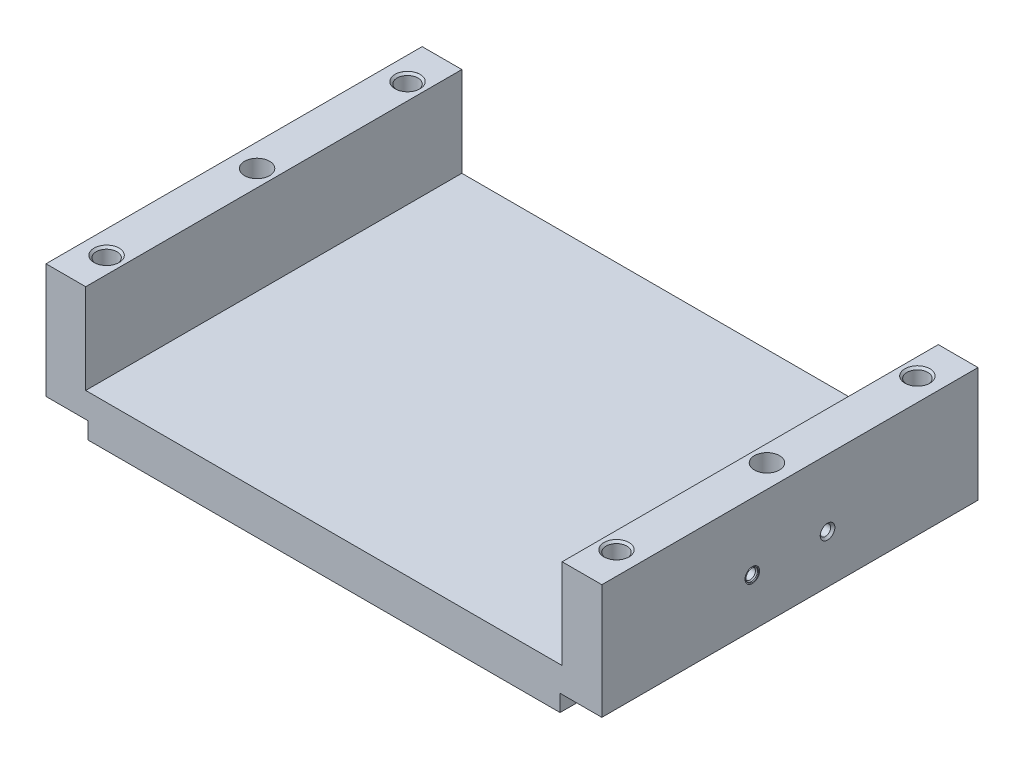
ISO-10303-21;
HEADER;
FILE_DESCRIPTION(('STEP AP214'),'2;1');
FILE_NAME('part.step','',(''),(''),'','','');
FILE_SCHEMA(('AUTOMOTIVE_DESIGN { 1 0 10303 214 1 1 1 1 }'));
ENDSEC;
DATA;
#1=APPLICATION_CONTEXT('core data for automotive mechanical design processes');
#2=APPLICATION_PROTOCOL_DEFINITION('international standard','automotive_design',2000,#1);
#3=PRODUCT_CONTEXT('',#1,'mechanical');
#4=PRODUCT('Part','Part','',(#3));
#5=PRODUCT_RELATED_PRODUCT_CATEGORY('part','',(#4));
#6=PRODUCT_DEFINITION_FORMATION('','',#4);
#7=PRODUCT_DEFINITION_CONTEXT('part definition',#1,'design');
#8=PRODUCT_DEFINITION('design','',#6,#7);
#9=PRODUCT_DEFINITION_SHAPE('','',#8);
#10=(LENGTH_UNIT() NAMED_UNIT(*) SI_UNIT(.MILLI.,.METRE.));
#11=(NAMED_UNIT(*) PLANE_ANGLE_UNIT() SI_UNIT($,.RADIAN.));
#12=(NAMED_UNIT(*) SI_UNIT($,.STERADIAN.) SOLID_ANGLE_UNIT());
#13=UNCERTAINTY_MEASURE_WITH_UNIT(LENGTH_MEASURE(1.E-05),#10,'distance_accuracy_value','');
#14=(GEOMETRIC_REPRESENTATION_CONTEXT(3) GLOBAL_UNCERTAINTY_ASSIGNED_CONTEXT((#13)) GLOBAL_UNIT_ASSIGNED_CONTEXT((#10,
#11,#12)) REPRESENTATION_CONTEXT('',''));
#15=CARTESIAN_POINT('',(0.,0.,0.));
#16=DIRECTION('',(0.,0.,1.));
#17=DIRECTION('',(1.,0.,0.));
#18=AXIS2_PLACEMENT_3D('',#15,#16,#17);
#19=CARTESIAN_POINT('',(-59.30362026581,26.5,9.));
#20=DIRECTION('',(-1.,0.,0.));
#21=DIRECTION('',(0.,0.,1.));
#22=AXIS2_PLACEMENT_3D('',#19,#20,#21);
#23=CYLINDRICAL_SURFACE('',#22,1.5);
#24=CARTESIAN_POINT('',(-59.5,26.5,9.));
#25=DIRECTION('',(-1.,0.,0.));
#26=DIRECTION('',(0.,0.,1.));
#27=AXIS2_PLACEMENT_3D('',#24,#25,#26);
#28=CIRCLE('',#27,1.5);
#29=CARTESIAN_POINT('',(-59.5,26.5,10.5));
#30=VERTEX_POINT('',#29);
#31=EDGE_CURVE('P0_E16',#30,#30,#28,.T.);
#32=ORIENTED_EDGE('',*,*,#31,.T.);
#33=EDGE_LOOP('',(#32));
#34=FACE_BOUND('',#33,.T.);
#35=CARTESIAN_POINT('',(-66.5,26.5,9.));
#36=DIRECTION('',(-1.,0.,0.));
#37=DIRECTION('',(0.,0.,1.));
#38=AXIS2_PLACEMENT_3D('',#35,#36,#37);
#39=CIRCLE('',#38,1.5);
#40=CARTESIAN_POINT('',(-66.5,26.5,10.5));
#41=VERTEX_POINT('',#40);
#42=EDGE_CURVE('P0_E10',#41,#41,#39,.F.);
#43=ORIENTED_EDGE('',*,*,#42,.T.);
#44=EDGE_LOOP('',(#43));
#45=FACE_BOUND('',#44,.T.);
#46=ADVANCED_FACE('P0_F15',(#34,#45),#23,.T.);
#47=OPEN_SHELL('',(#46));
#48=SHELL_BASED_SURFACE_MODEL('P0_B1',(#47));
#49=CARTESIAN_POINT('',(-66.69637973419,26.5,-9.));
#50=DIRECTION('',(1.,0.,0.));
#51=DIRECTION('',(0.,0.,-1.));
#52=AXIS2_PLACEMENT_3D('',#49,#50,#51);
#53=CYLINDRICAL_SURFACE('',#52,1.5);
#54=CARTESIAN_POINT('',(-59.5,26.5,-9.));
#55=DIRECTION('',(1.,0.,0.));
#56=DIRECTION('',(0.,0.,-1.));
#57=AXIS2_PLACEMENT_3D('',#54,#55,#56);
#58=CIRCLE('',#57,1.5);
#59=CARTESIAN_POINT('',(-59.5,26.5,-10.5));
#60=VERTEX_POINT('',#59);
#61=EDGE_CURVE('P1_E16',#60,#60,#58,.F.);
#62=ORIENTED_EDGE('',*,*,#61,.T.);
#63=EDGE_LOOP('',(#62));
#64=FACE_BOUND('',#63,.T.);
#65=CARTESIAN_POINT('',(-66.5,26.5,-9.));
#66=DIRECTION('',(1.,0.,0.));
#67=DIRECTION('',(0.,0.,-1.));
#68=AXIS2_PLACEMENT_3D('',#65,#66,#67);
#69=CIRCLE('',#68,1.5);
#70=CARTESIAN_POINT('',(-66.5,26.5,-10.5));
#71=VERTEX_POINT('',#70);
#72=EDGE_CURVE('P1_E10',#71,#71,#69,.T.);
#73=ORIENTED_EDGE('',*,*,#72,.T.);
#74=EDGE_LOOP('',(#73));
#75=FACE_BOUND('',#74,.T.);
#76=ADVANCED_FACE('P1_F15',(#64,#75),#53,.T.);
#77=OPEN_SHELL('',(#76));
#78=SHELL_BASED_SURFACE_MODEL('P1_B1',(#77));
#79=CARTESIAN_POINT('',(-61.,27.5,-36.));
#80=DIRECTION('',(0.,1.,0.));
#81=DIRECTION('',(0.,0.,1.));
#82=AXIS2_PLACEMENT_3D('',#79,#80,#81);
#83=PLANE('',#82);
#84=CARTESIAN_POINT('',(-61.,27.5,-36.));
#85=DIRECTION('',(0.,1.,0.));
#86=DIRECTION('',(0.,0.,1.));
#87=AXIS2_PLACEMENT_3D('',#84,#85,#86);
#88=CIRCLE('',#87,2.5);
#89=CARTESIAN_POINT('',(-61.,27.5,-33.5));
#90=VERTEX_POINT('',#89);
#91=EDGE_CURVE('P2_E20',#90,#90,#88,.T.);
#92=ORIENTED_EDGE('',*,*,#91,.T.);
#93=EDGE_LOOP('',(#92));
#94=FACE_BOUND('',#93,.T.);
#95=ADVANCED_FACE('P2_F17',(#94),#83,.T.);
#96=CARTESIAN_POINT('',(-61.,27.5,36.));
#97=DIRECTION('',(0.,1.,0.));
#98=DIRECTION('',(0.,0.,1.));
#99=AXIS2_PLACEMENT_3D('',#96,#97,#98);
#100=PLANE('',#99);
#101=CARTESIAN_POINT('',(-61.,27.5,36.));
#102=DIRECTION('',(0.,1.,0.));
#103=DIRECTION('',(0.,0.,1.));
#104=AXIS2_PLACEMENT_3D('',#101,#102,#103);
#105=CIRCLE('',#104,2.5);
#106=CARTESIAN_POINT('',(-61.,27.5,38.5));
#107=VERTEX_POINT('',#106);
#108=EDGE_CURVE('P2_E232',#107,#107,#105,.T.);
#109=ORIENTED_EDGE('',*,*,#108,.T.);
#110=EDGE_LOOP('',(#109));
#111=FACE_BOUND('',#110,.T.);
#112=ADVANCED_FACE('P2_F472',(#111),#100,.T.);
#113=CARTESIAN_POINT('',(-59.5,26.5,-9.));
#114=DIRECTION('',(1.,0.,0.));
#115=DIRECTION('',(0.,0.,-1.));
#116=AXIS2_PLACEMENT_3D('',#113,#114,#115);
#117=PLANE('',#116);
#118=CARTESIAN_POINT('',(-59.5,26.5,-9.));
#119=DIRECTION('',(-1.,0.,0.));
#120=DIRECTION('',(0.,0.,1.));
#121=AXIS2_PLACEMENT_3D('',#118,#119,#120);
#122=CIRCLE('',#121,1.25);
#123=CARTESIAN_POINT('',(-59.5,26.5,-7.75));
#124=VERTEX_POINT('',#123);
#125=EDGE_CURVE('P2_E230',#124,#124,#122,.T.);
#126=ORIENTED_EDGE('',*,*,#125,.T.);
#127=EDGE_LOOP('',(#126));
#128=FACE_BOUND('',#127,.T.);
#129=ADVANCED_FACE('P2_F469',(#128),#117,.F.);
#130=CARTESIAN_POINT('',(-59.5,26.5,9.));
#131=DIRECTION('',(1.,0.,0.));
#132=DIRECTION('',(0.,0.,-1.));
#133=AXIS2_PLACEMENT_3D('',#130,#131,#132);
#134=PLANE('',#133);
#135=CARTESIAN_POINT('',(-59.5,26.5,9.));
#136=DIRECTION('',(-1.,0.,0.));
#137=DIRECTION('',(0.,0.,1.));
#138=AXIS2_PLACEMENT_3D('',#135,#136,#137);
#139=CIRCLE('',#138,1.25);
#140=CARTESIAN_POINT('',(-59.5,26.5,10.25));
#141=VERTEX_POINT('',#140);
#142=EDGE_CURVE('P2_E227',#141,#141,#139,.T.);
#143=ORIENTED_EDGE('',*,*,#142,.T.);
#144=EDGE_LOOP('',(#143));
#145=FACE_BOUND('',#144,.T.);
#146=ADVANCED_FACE('P2_F465',(#145),#134,.F.);
#147=CARTESIAN_POINT('',(59.5,26.5,-9.));
#148=DIRECTION('',(1.,0.,0.));
#149=DIRECTION('',(0.,0.,-1.));
#150=AXIS2_PLACEMENT_3D('',#147,#148,#149);
#151=PLANE('',#150);
#152=CARTESIAN_POINT('',(59.5,26.5,-9.));
#153=DIRECTION('',(-1.,0.,0.));
#154=DIRECTION('',(0.,0.,1.));
#155=AXIS2_PLACEMENT_3D('',#152,#153,#154);
#156=CIRCLE('',#155,1.25);
#157=CARTESIAN_POINT('',(59.5,26.5,-7.75));
#158=VERTEX_POINT('',#157);
#159=EDGE_CURVE('P2_E224',#158,#158,#156,.F.);
#160=ORIENTED_EDGE('',*,*,#159,.T.);
#161=EDGE_LOOP('',(#160));
#162=FACE_BOUND('',#161,.T.);
#163=ADVANCED_FACE('P2_F461',(#162),#151,.T.);
#164=CARTESIAN_POINT('',(59.5,26.5,9.));
#165=DIRECTION('',(1.,0.,0.));
#166=DIRECTION('',(0.,0.,-1.));
#167=AXIS2_PLACEMENT_3D('',#164,#165,#166);
#168=PLANE('',#167);
#169=CARTESIAN_POINT('',(59.5,26.5,9.));
#170=DIRECTION('',(-1.,0.,0.));
#171=DIRECTION('',(0.,0.,1.));
#172=AXIS2_PLACEMENT_3D('',#169,#170,#171);
#173=CIRCLE('',#172,1.25);
#174=CARTESIAN_POINT('',(59.5,26.5,10.25));
#175=VERTEX_POINT('',#174);
#176=EDGE_CURVE('P2_E221',#175,#175,#173,.F.);
#177=ORIENTED_EDGE('',*,*,#176,.T.);
#178=EDGE_LOOP('',(#177));
#179=FACE_BOUND('',#178,.T.);
#180=ADVANCED_FACE('P2_F457',(#179),#168,.T.);
#181=CARTESIAN_POINT('',(61.,27.5,-36.));
#182=DIRECTION('',(0.,1.,0.));
#183=DIRECTION('',(0.,0.,1.));
#184=AXIS2_PLACEMENT_3D('',#181,#182,#183);
#185=PLANE('',#184);
#186=CARTESIAN_POINT('',(61.,27.5,-36.));
#187=DIRECTION('',(0.,1.,0.));
#188=DIRECTION('',(0.,0.,1.));
#189=AXIS2_PLACEMENT_3D('',#186,#187,#188);
#190=CIRCLE('',#189,2.5);
#191=CARTESIAN_POINT('',(61.,27.5,-33.5));
#192=VERTEX_POINT('',#191);
#193=EDGE_CURVE('P2_E218',#192,#192,#190,.T.);
#194=ORIENTED_EDGE('',*,*,#193,.T.);
#195=EDGE_LOOP('',(#194));
#196=FACE_BOUND('',#195,.T.);
#197=ADVANCED_FACE('P2_F453',(#196),#185,.T.);
#198=CARTESIAN_POINT('',(61.,27.5,36.));
#199=DIRECTION('',(0.,1.,0.));
#200=DIRECTION('',(0.,0.,1.));
#201=AXIS2_PLACEMENT_3D('',#198,#199,#200);
#202=PLANE('',#201);
#203=CARTESIAN_POINT('',(61.,27.5,36.));
#204=DIRECTION('',(0.,1.,0.));
#205=DIRECTION('',(0.,0.,1.));
#206=AXIS2_PLACEMENT_3D('',#203,#204,#205);
#207=CIRCLE('',#206,2.5);
#208=CARTESIAN_POINT('',(61.,27.5,38.5));
#209=VERTEX_POINT('',#208);
#210=EDGE_CURVE('P2_E215',#209,#209,#207,.T.);
#211=ORIENTED_EDGE('',*,*,#210,.T.);
#212=EDGE_LOOP('',(#211));
#213=FACE_BOUND('',#212,.T.);
#214=ADVANCED_FACE('P2_F449',(#213),#202,.T.);
#215=CARTESIAN_POINT('',(-61.,27.5,0.));
#216=DIRECTION('',(0.,1.,0.));
#217=DIRECTION('',(0.,0.,1.));
#218=AXIS2_PLACEMENT_3D('',#215,#216,#217);
#219=PLANE('',#218);
#220=CARTESIAN_POINT('',(-61.,27.5,0.));
#221=DIRECTION('',(0.,1.,0.));
#222=DIRECTION('',(0.,0.,1.));
#223=AXIS2_PLACEMENT_3D('',#220,#221,#222);
#224=CIRCLE('',#223,3.);
#225=CARTESIAN_POINT('',(-61.,27.5,3.));
#226=VERTEX_POINT('',#225);
#227=EDGE_CURVE('P2_E188',#226,#226,#224,.T.);
#228=ORIENTED_EDGE('',*,*,#227,.T.);
#229=EDGE_LOOP('',(#228));
#230=FACE_BOUND('',#229,.T.);
#231=ADVANCED_FACE('P2_F244',(#230),#219,.T.);
#232=CARTESIAN_POINT('',(-61.,27.21,-36.));
#233=DIRECTION('',(0.,1.,0.));
#234=DIRECTION('',(0.,0.,1.));
#235=AXIS2_PLACEMENT_3D('',#232,#233,#234);
#236=CYLINDRICAL_SURFACE('',#235,2.5);
#237=ORIENTED_EDGE('',*,*,#91,.F.);
#238=EDGE_LOOP('',(#237));
#239=FACE_BOUND('',#238,.T.);
#240=CARTESIAN_POINT('',(-61.,42.00000000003,-36.));
#241=DIRECTION('',(0.,1.,0.));
#242=DIRECTION('',(0.,0.,-1.));
#243=AXIS2_PLACEMENT_3D('',#240,#241,#242);
#244=CIRCLE('',#243,2.49999999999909);
#245=CARTESIAN_POINT('',(-61.,42.00000000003,-38.4999999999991));
#246=VERTEX_POINT('',#245);
#247=EDGE_CURVE('P2_E185',#246,#246,#244,.T.);
#248=ORIENTED_EDGE('',*,*,#247,.T.);
#249=EDGE_LOOP('',(#248));
#250=FACE_BOUND('',#249,.T.);
#251=ADVANCED_FACE('P2_F240',(#239,#250),#236,.F.);
#252=CARTESIAN_POINT('',(-61.,27.21,36.));
#253=DIRECTION('',(0.,1.,0.));
#254=DIRECTION('',(0.,0.,1.));
#255=AXIS2_PLACEMENT_3D('',#252,#253,#254);
#256=CYLINDRICAL_SURFACE('',#255,2.5);
#257=ORIENTED_EDGE('',*,*,#108,.F.);
#258=EDGE_LOOP('',(#257));
#259=FACE_BOUND('',#258,.T.);
#260=CARTESIAN_POINT('',(-61.,42.00000000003,36.));
#261=DIRECTION('',(0.,1.,0.));
#262=DIRECTION('',(0.,0.,-1.));
#263=AXIS2_PLACEMENT_3D('',#260,#261,#262);
#264=CIRCLE('',#263,2.49999999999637);
#265=CARTESIAN_POINT('',(-61.,42.00000000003,33.5000000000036));
#266=VERTEX_POINT('',#265);
#267=EDGE_CURVE('P2_E180',#266,#266,#264,.T.);
#268=ORIENTED_EDGE('',*,*,#267,.T.);
#269=EDGE_LOOP('',(#268));
#270=FACE_BOUND('',#269,.T.);
#271=ADVANCED_FACE('P2_F243',(#259,#270),#256,.F.);
#272=CARTESIAN_POINT('',(-59.30362026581,26.5,-9.));
#273=DIRECTION('',(-1.,0.,0.));
#274=DIRECTION('',(0.,0.,1.));
#275=AXIS2_PLACEMENT_3D('',#272,#273,#274);
#276=CYLINDRICAL_SURFACE('',#275,1.25);
#277=ORIENTED_EDGE('',*,*,#125,.F.);
#278=EDGE_LOOP('',(#277));
#279=FACE_BOUND('',#278,.T.);
#280=CARTESIAN_POINT('',(-65.9999999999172,26.5,-9.));
#281=DIRECTION('',(-1.,0.,0.));
#282=DIRECTION('',(0.,0.,-1.));
#283=AXIS2_PLACEMENT_3D('',#280,#281,#282);
#284=CIRCLE('',#283,1.24999999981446);
#285=CARTESIAN_POINT('',(-65.9999999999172,26.5,-10.2499999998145));
#286=VERTEX_POINT('',#285);
#287=EDGE_CURVE('P2_E177',#286,#286,#284,.T.);
#288=ORIENTED_EDGE('',*,*,#287,.T.);
#289=EDGE_LOOP('',(#288));
#290=FACE_BOUND('',#289,.T.);
#291=ADVANCED_FACE('P2_F439',(#279,#290),#276,.F.);
#292=CARTESIAN_POINT('',(-59.30362026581,26.5,9.));
#293=DIRECTION('',(-1.,0.,0.));
#294=DIRECTION('',(0.,0.,1.));
#295=AXIS2_PLACEMENT_3D('',#292,#293,#294);
#296=CYLINDRICAL_SURFACE('',#295,1.25);
#297=ORIENTED_EDGE('',*,*,#142,.F.);
#298=EDGE_LOOP('',(#297));
#299=FACE_BOUND('',#298,.T.);
#300=CARTESIAN_POINT('',(-65.9999999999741,26.5,9.));
#301=DIRECTION('',(-1.,0.,0.));
#302=DIRECTION('',(0.,0.,-1.));
#303=AXIS2_PLACEMENT_3D('',#300,#301,#302);
#304=CIRCLE('',#303,1.25000000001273);
#305=CARTESIAN_POINT('',(-65.9999999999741,26.5,7.74999999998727));
#306=VERTEX_POINT('',#305);
#307=EDGE_CURVE('P2_E174',#306,#306,#304,.T.);
#308=ORIENTED_EDGE('',*,*,#307,.T.);
#309=EDGE_LOOP('',(#308));
#310=FACE_BOUND('',#309,.T.);
#311=ADVANCED_FACE('P2_F435',(#299,#310),#296,.F.);
#312=CARTESIAN_POINT('',(66.19637973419,26.5,-9.));
#313=DIRECTION('',(-1.,0.,0.));
#314=DIRECTION('',(0.,0.,1.));
#315=AXIS2_PLACEMENT_3D('',#312,#313,#314);
#316=CYLINDRICAL_SURFACE('',#315,1.25);
#317=ORIENTED_EDGE('',*,*,#159,.F.);
#318=EDGE_LOOP('',(#317));
#319=FACE_BOUND('',#318,.T.);
#320=CARTESIAN_POINT('',(65.9999999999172,26.5,-9.));
#321=DIRECTION('',(1.,0.,0.));
#322=DIRECTION('',(0.,0.,-1.));
#323=AXIS2_PLACEMENT_3D('',#320,#321,#322);
#324=CIRCLE('',#323,1.24999999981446);
#325=CARTESIAN_POINT('',(65.9999999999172,26.5,-10.2499999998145));
#326=VERTEX_POINT('',#325);
#327=EDGE_CURVE('P2_E171',#326,#326,#324,.T.);
#328=ORIENTED_EDGE('',*,*,#327,.T.);
#329=EDGE_LOOP('',(#328));
#330=FACE_BOUND('',#329,.T.);
#331=ADVANCED_FACE('P2_F431',(#319,#330),#316,.F.);
#332=CARTESIAN_POINT('',(66.19637973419,26.5,9.));
#333=DIRECTION('',(-1.,0.,0.));
#334=DIRECTION('',(0.,0.,1.));
#335=AXIS2_PLACEMENT_3D('',#332,#333,#334);
#336=CYLINDRICAL_SURFACE('',#335,1.25);
#337=ORIENTED_EDGE('',*,*,#176,.F.);
#338=EDGE_LOOP('',(#337));
#339=FACE_BOUND('',#338,.T.);
#340=CARTESIAN_POINT('',(65.9999999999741,26.5,9.));
#341=DIRECTION('',(1.,0.,0.));
#342=DIRECTION('',(0.,0.,-1.));
#343=AXIS2_PLACEMENT_3D('',#340,#341,#342);
#344=CIRCLE('',#343,1.25000000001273);
#345=CARTESIAN_POINT('',(65.9999999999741,26.5,7.74999999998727));
#346=VERTEX_POINT('',#345);
#347=EDGE_CURVE('P2_E168',#346,#346,#344,.T.);
#348=ORIENTED_EDGE('',*,*,#347,.T.);
#349=EDGE_LOOP('',(#348));
#350=FACE_BOUND('',#349,.T.);
#351=ADVANCED_FACE('P2_F427',(#339,#350),#336,.F.);
#352=CARTESIAN_POINT('',(61.,27.5,0.));
#353=DIRECTION('',(0.,1.,0.));
#354=DIRECTION('',(0.,0.,1.));
#355=AXIS2_PLACEMENT_3D('',#352,#353,#354);
#356=PLANE('',#355);
#357=CARTESIAN_POINT('',(61.,27.5,0.));
#358=DIRECTION('',(0.,1.,0.));
#359=DIRECTION('',(0.,0.,1.));
#360=AXIS2_PLACEMENT_3D('',#357,#358,#359);
#361=CIRCLE('',#360,3.);
#362=CARTESIAN_POINT('',(61.,27.5,3.));
#363=VERTEX_POINT('',#362);
#364=EDGE_CURVE('P2_E167',#363,#363,#361,.T.);
#365=ORIENTED_EDGE('',*,*,#364,.T.);
#366=EDGE_LOOP('',(#365));
#367=FACE_BOUND('',#366,.T.);
#368=ADVANCED_FACE('P2_F423',(#367),#356,.T.);
#369=CARTESIAN_POINT('',(61.,27.21,-36.));
#370=DIRECTION('',(0.,1.,0.));
#371=DIRECTION('',(0.,0.,1.));
#372=AXIS2_PLACEMENT_3D('',#369,#370,#371);
#373=CYLINDRICAL_SURFACE('',#372,2.5);
#374=ORIENTED_EDGE('',*,*,#193,.F.);
#375=EDGE_LOOP('',(#374));
#376=FACE_BOUND('',#375,.T.);
#377=CARTESIAN_POINT('',(61.,41.99999999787,-36.));
#378=DIRECTION('',(0.,1.,0.));
#379=DIRECTION('',(0.,0.,-1.));
#380=AXIS2_PLACEMENT_3D('',#377,#378,#379);
#381=CIRCLE('',#380,2.49999999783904);
#382=CARTESIAN_POINT('',(61.,41.99999999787,-38.499999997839));
#383=VERTEX_POINT('',#382);
#384=EDGE_CURVE('P2_E164',#383,#383,#381,.T.);
#385=ORIENTED_EDGE('',*,*,#384,.T.);
#386=EDGE_LOOP('',(#385));
#387=FACE_BOUND('',#386,.T.);
#388=ADVANCED_FACE('P2_F419',(#376,#387),#373,.F.);
#389=CARTESIAN_POINT('',(61.,27.21,36.));
#390=DIRECTION('',(0.,1.,0.));
#391=DIRECTION('',(0.,0.,1.));
#392=AXIS2_PLACEMENT_3D('',#389,#390,#391);
#393=CYLINDRICAL_SURFACE('',#392,2.5);
#394=ORIENTED_EDGE('',*,*,#210,.F.);
#395=EDGE_LOOP('',(#394));
#396=FACE_BOUND('',#395,.T.);
#397=CARTESIAN_POINT('',(61.,42.00000000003,36.));
#398=DIRECTION('',(0.,1.,0.));
#399=DIRECTION('',(0.,0.,-1.));
#400=AXIS2_PLACEMENT_3D('',#397,#398,#399);
#401=CIRCLE('',#400,2.49999999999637);
#402=CARTESIAN_POINT('',(61.,42.00000000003,33.5000000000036));
#403=VERTEX_POINT('',#402);
#404=EDGE_CURVE('P2_E160',#403,#403,#401,.T.);
#405=ORIENTED_EDGE('',*,*,#404,.T.);
#406=EDGE_LOOP('',(#405));
#407=FACE_BOUND('',#406,.T.);
#408=ADVANCED_FACE('P2_F415',(#396,#407),#393,.F.);
#409=CARTESIAN_POINT('',(-61.,27.2,0.));
#410=DIRECTION('',(0.,1.,0.));
#411=DIRECTION('',(0.,0.,1.));
#412=AXIS2_PLACEMENT_3D('',#409,#410,#411);
#413=CYLINDRICAL_SURFACE('',#412,3.);
#414=ORIENTED_EDGE('',*,*,#227,.F.);
#415=EDGE_LOOP('',(#414));
#416=FACE_BOUND('',#415,.T.);
#417=CARTESIAN_POINT('',(-61.,42.5,0.));
#418=DIRECTION('',(0.,1.,0.));
#419=DIRECTION('',(0.,0.,1.));
#420=AXIS2_PLACEMENT_3D('',#417,#418,#419);
#421=CIRCLE('',#420,3.);
#422=CARTESIAN_POINT('',(-61.,42.5,3.));
#423=VERTEX_POINT('',#422);
#424=EDGE_CURVE('P2_E163',#423,#423,#421,.F.);
#425=ORIENTED_EDGE('',*,*,#424,.F.);
#426=EDGE_LOOP('',(#425));
#427=FACE_BOUND('',#426,.T.);
#428=ADVANCED_FACE('P2_F252',(#416,#427),#413,.F.);
#429=CARTESIAN_POINT('',(-61.,42.5000000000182,-36.));
#430=DIRECTION('',(0.,1.,0.));
#431=DIRECTION('',(0.,0.,1.));
#432=AXIS2_PLACEMENT_3D('',#429,#430,#431);
#433=CONICAL_SURFACE('',#432,3.00000000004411,0.785398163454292);
#434=ORIENTED_EDGE('',*,*,#247,.F.);
#435=EDGE_LOOP('',(#434));
#436=FACE_BOUND('',#435,.T.);
#437=CARTESIAN_POINT('',(-61.,42.5000000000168,-36.));
#438=DIRECTION('',(0.,1.,0.));
#439=DIRECTION('',(0.,0.,1.));
#440=AXIS2_PLACEMENT_3D('',#437,#438,#439);
#441=CIRCLE('',#440,3.00000000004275);
#442=CARTESIAN_POINT('',(-61.,42.5000000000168,-32.9999999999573));
#443=VERTEX_POINT('',#442);
#444=EDGE_CURVE('P2_E206',#443,#443,#441,.F.);
#445=ORIENTED_EDGE('',*,*,#444,.F.);
#446=EDGE_LOOP('',(#445));
#447=FACE_BOUND('',#446,.T.);
#448=ADVANCED_FACE('P2_F248',(#436,#447),#433,.F.);
#449=CARTESIAN_POINT('',(-61.,42.5000000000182,36.));
#450=DIRECTION('',(0.,1.,0.));
#451=DIRECTION('',(0.,0.,1.));
#452=AXIS2_PLACEMENT_3D('',#449,#450,#451);
#453=CONICAL_SURFACE('',#452,3.00000000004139,0.785398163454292);
#454=ORIENTED_EDGE('',*,*,#267,.F.);
#455=EDGE_LOOP('',(#454));
#456=FACE_BOUND('',#455,.T.);
#457=CARTESIAN_POINT('',(-61.,42.5000000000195,36.));
#458=DIRECTION('',(0.,1.,0.));
#459=DIRECTION('',(0.,0.,1.));
#460=AXIS2_PLACEMENT_3D('',#457,#458,#459);
#461=CIRCLE('',#460,3.00000000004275);
#462=CARTESIAN_POINT('',(-61.,42.5000000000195,39.0000000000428));
#463=VERTEX_POINT('',#462);
#464=EDGE_CURVE('P2_E159',#463,#463,#461,.F.);
#465=ORIENTED_EDGE('',*,*,#464,.F.);
#466=EDGE_LOOP('',(#465));
#467=FACE_BOUND('',#466,.T.);
#468=ADVANCED_FACE('P2_F251',(#456,#467),#453,.F.);
#469=CARTESIAN_POINT('',(-66.5000000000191,26.5,-9.));
#470=DIRECTION('',(-1.,0.,0.));
#471=DIRECTION('',(0.,0.,1.));
#472=AXIS2_PLACEMENT_3D('',#469,#470,#471);
#473=CONICAL_SURFACE('',#472,1.74999999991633,0.785398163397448);
#474=ORIENTED_EDGE('',*,*,#287,.F.);
#475=EDGE_LOOP('',(#474));
#476=FACE_BOUND('',#475,.T.);
#477=CARTESIAN_POINT('',(-66.5000000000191,26.5,-9.));
#478=DIRECTION('',(-1.,0.,0.));
#479=DIRECTION('',(0.,0.,1.));
#480=AXIS2_PLACEMENT_3D('',#477,#478,#479);
#481=CIRCLE('',#480,1.74999999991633);
#482=CARTESIAN_POINT('',(-66.5000000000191,26.5,-7.25000000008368));
#483=VERTEX_POINT('',#482);
#484=EDGE_CURVE('P2_E158',#483,#483,#481,.T.);
#485=ORIENTED_EDGE('',*,*,#484,.T.);
#486=EDGE_LOOP('',(#485));
#487=FACE_BOUND('',#486,.T.);
#488=ADVANCED_FACE('P2_F405',(#476,#487),#473,.F.);
#489=CARTESIAN_POINT('',(-66.5000000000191,26.5,9.));
#490=DIRECTION('',(-1.,0.,0.));
#491=DIRECTION('',(0.,0.,1.));
#492=AXIS2_PLACEMENT_3D('',#489,#490,#491);
#493=CONICAL_SURFACE('',#492,1.75000000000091,0.785398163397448);
#494=ORIENTED_EDGE('',*,*,#307,.F.);
#495=EDGE_LOOP('',(#494));
#496=FACE_BOUND('',#495,.T.);
#497=CARTESIAN_POINT('',(-66.5000000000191,26.5,9.));
#498=DIRECTION('',(-1.,0.,0.));
#499=DIRECTION('',(0.,0.,1.));
#500=AXIS2_PLACEMENT_3D('',#497,#498,#499);
#501=CIRCLE('',#500,1.75000000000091);
#502=CARTESIAN_POINT('',(-66.5000000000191,26.5,10.7500000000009));
#503=VERTEX_POINT('',#502);
#504=EDGE_CURVE('P2_E120',#503,#503,#501,.T.);
#505=ORIENTED_EDGE('',*,*,#504,.T.);
#506=EDGE_LOOP('',(#505));
#507=FACE_BOUND('',#506,.T.);
#508=ADVANCED_FACE('P2_F401',(#496,#507),#493,.F.);
#509=CARTESIAN_POINT('',(66.5000000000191,26.5,-9.));
#510=DIRECTION('',(1.,0.,0.));
#511=DIRECTION('',(0.,0.,-1.));
#512=AXIS2_PLACEMENT_3D('',#509,#510,#511);
#513=CONICAL_SURFACE('',#512,1.74999999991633,0.785398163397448);
#514=ORIENTED_EDGE('',*,*,#327,.F.);
#515=EDGE_LOOP('',(#514));
#516=FACE_BOUND('',#515,.T.);
#517=CARTESIAN_POINT('',(66.5000000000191,26.5,-9.));
#518=DIRECTION('',(1.,0.,0.));
#519=DIRECTION('',(0.,0.,-1.));
#520=AXIS2_PLACEMENT_3D('',#517,#518,#519);
#521=CIRCLE('',#520,1.74999999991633);
#522=CARTESIAN_POINT('',(66.5000000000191,26.5,-10.7499999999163));
#523=VERTEX_POINT('',#522);
#524=EDGE_CURVE('P2_E148',#523,#523,#521,.F.);
#525=ORIENTED_EDGE('',*,*,#524,.F.);
#526=EDGE_LOOP('',(#525));
#527=FACE_BOUND('',#526,.T.);
#528=ADVANCED_FACE('P2_F397',(#516,#527),#513,.F.);
#529=CARTESIAN_POINT('',(66.5000000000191,26.5,9.));
#530=DIRECTION('',(1.,0.,0.));
#531=DIRECTION('',(0.,0.,-1.));
#532=AXIS2_PLACEMENT_3D('',#529,#530,#531);
#533=CONICAL_SURFACE('',#532,1.75000000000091,0.785398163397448);
#534=ORIENTED_EDGE('',*,*,#347,.F.);
#535=EDGE_LOOP('',(#534));
#536=FACE_BOUND('',#535,.T.);
#537=CARTESIAN_POINT('',(66.5000000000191,26.5,9.));
#538=DIRECTION('',(1.,0.,0.));
#539=DIRECTION('',(0.,0.,-1.));
#540=AXIS2_PLACEMENT_3D('',#537,#538,#539);
#541=CIRCLE('',#540,1.75000000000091);
#542=CARTESIAN_POINT('',(66.5000000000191,26.5,7.24999999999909));
#543=VERTEX_POINT('',#542);
#544=EDGE_CURVE('P2_E144',#543,#543,#541,.F.);
#545=ORIENTED_EDGE('',*,*,#544,.F.);
#546=EDGE_LOOP('',(#545));
#547=FACE_BOUND('',#546,.T.);
#548=ADVANCED_FACE('P2_F393',(#536,#547),#533,.F.);
#549=CARTESIAN_POINT('',(61.,27.2,0.));
#550=DIRECTION('',(0.,1.,0.));
#551=DIRECTION('',(0.,0.,1.));
#552=AXIS2_PLACEMENT_3D('',#549,#550,#551);
#553=CYLINDRICAL_SURFACE('',#552,3.);
#554=ORIENTED_EDGE('',*,*,#364,.F.);
#555=EDGE_LOOP('',(#554));
#556=FACE_BOUND('',#555,.T.);
#557=CARTESIAN_POINT('',(61.,42.5,0.));
#558=DIRECTION('',(0.,1.,0.));
#559=DIRECTION('',(0.,0.,1.));
#560=AXIS2_PLACEMENT_3D('',#557,#558,#559);
#561=CIRCLE('',#560,3.);
#562=CARTESIAN_POINT('',(61.,42.5,3.));
#563=VERTEX_POINT('',#562);
#564=EDGE_CURVE('P2_E143',#563,#563,#561,.F.);
#565=ORIENTED_EDGE('',*,*,#564,.F.);
#566=EDGE_LOOP('',(#565));
#567=FACE_BOUND('',#566,.T.);
#568=ADVANCED_FACE('P2_F389',(#556,#567),#553,.F.);
#569=CARTESIAN_POINT('',(61.,42.5000000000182,-36.));
#570=DIRECTION('',(0.,1.,0.));
#571=DIRECTION('',(0.,0.,1.));
#572=AXIS2_PLACEMENT_3D('',#569,#570,#571);
#573=CONICAL_SURFACE('',#572,3.00000000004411,0.785398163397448);
#574=ORIENTED_EDGE('',*,*,#384,.F.);
#575=EDGE_LOOP('',(#574));
#576=FACE_BOUND('',#575,.T.);
#577=CARTESIAN_POINT('',(61.,42.5000000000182,-36.));
#578=DIRECTION('',(0.,1.,0.));
#579=DIRECTION('',(0.,0.,1.));
#580=AXIS2_PLACEMENT_3D('',#577,#578,#579);
#581=CIRCLE('',#580,3.00000000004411);
#582=CARTESIAN_POINT('',(61.,42.5000000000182,-32.9999999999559));
#583=VERTEX_POINT('',#582);
#584=EDGE_CURVE('P2_E191',#583,#583,#581,.F.);
#585=ORIENTED_EDGE('',*,*,#584,.F.);
#586=EDGE_LOOP('',(#585));
#587=FACE_BOUND('',#586,.T.);
#588=ADVANCED_FACE('P2_F385',(#576,#587),#573,.F.);
#589=CARTESIAN_POINT('',(61.,42.5000000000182,36.));
#590=DIRECTION('',(0.,1.,0.));
#591=DIRECTION('',(0.,0.,1.));
#592=AXIS2_PLACEMENT_3D('',#589,#590,#591);
#593=CONICAL_SURFACE('',#592,3.00000000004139,0.785398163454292);
#594=ORIENTED_EDGE('',*,*,#404,.F.);
#595=EDGE_LOOP('',(#594));
#596=FACE_BOUND('',#595,.T.);
#597=CARTESIAN_POINT('',(61.,42.5000000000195,36.));
#598=DIRECTION('',(0.,1.,0.));
#599=DIRECTION('',(0.,0.,1.));
#600=AXIS2_PLACEMENT_3D('',#597,#598,#599);
#601=CIRCLE('',#600,3.00000000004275);
#602=CARTESIAN_POINT('',(61.,42.5000000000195,39.0000000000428));
#603=VERTEX_POINT('',#602);
#604=EDGE_CURVE('P2_E136',#603,#603,#601,.F.);
#605=ORIENTED_EDGE('',*,*,#604,.F.);
#606=EDGE_LOOP('',(#605));
#607=FACE_BOUND('',#606,.T.);
#608=ADVANCED_FACE('P2_F259',(#596,#607),#593,.F.);
#609=CARTESIAN_POINT('',(-61.75,42.5,0.));
#610=DIRECTION('',(0.,1.,0.));
#611=DIRECTION('',(0.,0.,1.));
#612=AXIS2_PLACEMENT_3D('',#609,#610,#611);
#613=PLANE('',#612);
#614=ORIENTED_EDGE('',*,*,#464,.T.);
#615=EDGE_LOOP('',(#614));
#616=FACE_BOUND('',#615,.T.);
#617=ORIENTED_EDGE('',*,*,#444,.T.);
#618=EDGE_LOOP('',(#617));
#619=FACE_BOUND('',#618,.T.);
#620=ORIENTED_EDGE('',*,*,#424,.T.);
#621=EDGE_LOOP('',(#620));
#622=FACE_BOUND('',#621,.T.);
#623=DIRECTION('',(0.,0.,-1.));
#624=VECTOR('',#623,1.);
#625=CARTESIAN_POINT('',(-57.,42.5,0.));
#626=LINE('',#625,#624);
#627=CARTESIAN_POINT('',(-57.,42.5,-45.));
#628=VERTEX_POINT('',#627);
#629=CARTESIAN_POINT('',(-57.,42.5,45.));
#630=VERTEX_POINT('',#629);
#631=EDGE_CURVE('P2_E134',#628,#630,#626,.F.);
#632=ORIENTED_EDGE('',*,*,#631,.F.);
#633=DIRECTION('',(1.,0.,0.));
#634=VECTOR('',#633,1.);
#635=CARTESIAN_POINT('',(0.,42.5,-45.));
#636=LINE('',#635,#634);
#637=CARTESIAN_POINT('',(-66.5,42.5,-45.));
#638=VERTEX_POINT('',#637);
#639=EDGE_CURVE('P2_E265',#628,#638,#636,.F.);
#640=ORIENTED_EDGE('',*,*,#639,.T.);
#641=DIRECTION('',(0.,0.,-1.));
#642=VECTOR('',#641,1.);
#643=CARTESIAN_POINT('',(-66.5,42.5,0.));
#644=LINE('',#643,#642);
#645=CARTESIAN_POINT('',(-66.5,42.5,45.));
#646=VERTEX_POINT('',#645);
#647=EDGE_CURVE('P2_E104',#638,#646,#644,.F.);
#648=ORIENTED_EDGE('',*,*,#647,.T.);
#649=DIRECTION('',(1.,0.,0.));
#650=VECTOR('',#649,1.);
#651=CARTESIAN_POINT('',(0.,42.5,45.));
#652=LINE('',#651,#650);
#653=EDGE_CURVE('P2_E133',#630,#646,#652,.F.);
#654=ORIENTED_EDGE('',*,*,#653,.F.);
#655=EDGE_LOOP('',(#632,#640,#648,#654));
#656=FACE_BOUND('',#655,.T.);
#657=ADVANCED_FACE('P2_F256',(#616,#619,#622,#656),#613,.T.);
#658=CARTESIAN_POINT('',(-66.5,28.75,0.));
#659=DIRECTION('',(1.,0.,0.));
#660=DIRECTION('',(0.,0.,-1.));
#661=AXIS2_PLACEMENT_3D('',#658,#659,#660);
#662=PLANE('',#661);
#663=ORIENTED_EDGE('',*,*,#504,.F.);
#664=EDGE_LOOP('',(#663));
#665=FACE_BOUND('',#664,.T.);
#666=ORIENTED_EDGE('',*,*,#484,.F.);
#667=EDGE_LOOP('',(#666));
#668=FACE_BOUND('',#667,.T.);
#669=DIRECTION('',(0.,1.,0.));
#670=VECTOR('',#669,1.);
#671=CARTESIAN_POINT('',(-66.5,26.75,45.));
#672=LINE('',#671,#670);
#673=CARTESIAN_POINT('',(-66.5,15.,45.));
#674=VERTEX_POINT('',#673);
#675=EDGE_CURVE('P2_E113',#646,#674,#672,.F.);
#676=ORIENTED_EDGE('',*,*,#675,.F.);
#677=ORIENTED_EDGE('',*,*,#647,.F.);
#678=DIRECTION('',(0.,1.,0.));
#679=VECTOR('',#678,1.);
#680=CARTESIAN_POINT('',(-66.5,26.75,-45.));
#681=LINE('',#680,#679);
#682=CARTESIAN_POINT('',(-66.5,15.,-45.));
#683=VERTEX_POINT('',#682);
#684=EDGE_CURVE('P2_E116',#638,#683,#681,.F.);
#685=ORIENTED_EDGE('',*,*,#684,.T.);
#686=DIRECTION('',(0.,0.,1.));
#687=VECTOR('',#686,1.);
#688=CARTESIAN_POINT('',(-66.5,15.,0.));
#689=LINE('',#688,#687);
#690=EDGE_CURVE('P2_E109',#683,#674,#689,.T.);
#691=ORIENTED_EDGE('',*,*,#690,.T.);
#692=EDGE_LOOP('',(#676,#677,#685,#691));
#693=FACE_BOUND('',#692,.T.);
#694=ADVANCED_FACE('P2_F111',(#665,#668,#693),#662,.F.);
#695=CARTESIAN_POINT('',(-61.5,15.,0.));
#696=DIRECTION('',(0.,1.,0.));
#697=DIRECTION('',(0.,0.,1.));
#698=AXIS2_PLACEMENT_3D('',#695,#696,#697);
#699=PLANE('',#698);
#700=DIRECTION('',(1.,0.,0.));
#701=VECTOR('',#700,1.);
#702=CARTESIAN_POINT('',(0.,15.,45.));
#703=LINE('',#702,#701);
#704=CARTESIAN_POINT('',(-56.5,15.,45.));
#705=VERTEX_POINT('',#704);
#706=EDGE_CURVE('P2_E123',#674,#705,#703,.T.);
#707=ORIENTED_EDGE('',*,*,#706,.F.);
#708=ORIENTED_EDGE('',*,*,#690,.F.);
#709=DIRECTION('',(1.,0.,0.));
#710=VECTOR('',#709,1.);
#711=CARTESIAN_POINT('',(0.,15.,-45.));
#712=LINE('',#711,#710);
#713=CARTESIAN_POINT('',(-56.5,15.,-45.));
#714=VERTEX_POINT('',#713);
#715=EDGE_CURVE('P2_E277',#683,#714,#712,.T.);
#716=ORIENTED_EDGE('',*,*,#715,.T.);
#717=DIRECTION('',(0.,0.,-1.));
#718=VECTOR('',#717,1.);
#719=CARTESIAN_POINT('',(-56.5,15.,0.));
#720=LINE('',#719,#718);
#721=EDGE_CURVE('P2_E119',#714,#705,#720,.F.);
#722=ORIENTED_EDGE('',*,*,#721,.T.);
#723=EDGE_LOOP('',(#707,#708,#716,#722));
#724=FACE_BOUND('',#723,.T.);
#725=ADVANCED_FACE('P2_F124',(#724),#699,.F.);
#726=CARTESIAN_POINT('',(-56.5,13.,0.));
#727=DIRECTION('',(1.,0.,0.));
#728=DIRECTION('',(0.,0.,-1.));
#729=AXIS2_PLACEMENT_3D('',#726,#727,#728);
#730=PLANE('',#729);
#731=DIRECTION('',(0.,1.,0.));
#732=VECTOR('',#731,1.);
#733=CARTESIAN_POINT('',(-56.5,26.75,45.));
#734=LINE('',#733,#732);
#735=CARTESIAN_POINT('',(-56.5,11.,45.));
#736=VERTEX_POINT('',#735);
#737=EDGE_CURVE('P2_E129',#705,#736,#734,.F.);
#738=ORIENTED_EDGE('',*,*,#737,.F.);
#739=ORIENTED_EDGE('',*,*,#721,.F.);
#740=DIRECTION('',(0.,1.,0.));
#741=VECTOR('',#740,1.);
#742=CARTESIAN_POINT('',(-56.5,26.75,-45.));
#743=LINE('',#742,#741);
#744=CARTESIAN_POINT('',(-56.5,11.,-45.));
#745=VERTEX_POINT('',#744);
#746=EDGE_CURVE('P2_E306',#714,#745,#743,.F.);
#747=ORIENTED_EDGE('',*,*,#746,.T.);
#748=DIRECTION('',(0.,0.,1.));
#749=VECTOR('',#748,1.);
#750=CARTESIAN_POINT('',(-56.5,11.,0.));
#751=LINE('',#750,#749);
#752=EDGE_CURVE('P2_E154',#745,#736,#751,.T.);
#753=ORIENTED_EDGE('',*,*,#752,.T.);
#754=EDGE_LOOP('',(#738,#739,#747,#753));
#755=FACE_BOUND('',#754,.T.);
#756=ADVANCED_FACE('P2_F303',(#755),#730,.F.);
#757=CARTESIAN_POINT('',(0.,11.,0.));
#758=DIRECTION('',(0.,1.,0.));
#759=DIRECTION('',(0.,0.,1.));
#760=AXIS2_PLACEMENT_3D('',#757,#758,#759);
#761=PLANE('',#760);
#762=DIRECTION('',(1.,0.,0.));
#763=VECTOR('',#762,1.);
#764=CARTESIAN_POINT('',(0.,11.,45.));
#765=LINE('',#764,#763);
#766=CARTESIAN_POINT('',(56.5,11.,45.));
#767=VERTEX_POINT('',#766);
#768=EDGE_CURVE('P2_E299',#736,#767,#765,.T.);
#769=ORIENTED_EDGE('',*,*,#768,.F.);
#770=ORIENTED_EDGE('',*,*,#752,.F.);
#771=DIRECTION('',(1.,0.,0.));
#772=VECTOR('',#771,1.);
#773=CARTESIAN_POINT('',(0.,11.,-45.));
#774=LINE('',#773,#772);
#775=CARTESIAN_POINT('',(56.5,11.,-45.));
#776=VERTEX_POINT('',#775);
#777=EDGE_CURVE('P2_E311',#745,#776,#774,.T.);
#778=ORIENTED_EDGE('',*,*,#777,.T.);
#779=DIRECTION('',(0.,0.,-1.));
#780=VECTOR('',#779,1.);
#781=CARTESIAN_POINT('',(56.5,11.,0.));
#782=LINE('',#781,#780);
#783=EDGE_CURVE('P2_E151',#767,#776,#782,.T.);
#784=ORIENTED_EDGE('',*,*,#783,.F.);
#785=EDGE_LOOP('',(#769,#770,#778,#784));
#786=FACE_BOUND('',#785,.T.);
#787=ADVANCED_FACE('P2_F309',(#786),#761,.F.);
#788=CARTESIAN_POINT('',(56.5,13.,0.));
#789=DIRECTION('',(1.,0.,0.));
#790=DIRECTION('',(0.,0.,-1.));
#791=AXIS2_PLACEMENT_3D('',#788,#789,#790);
#792=PLANE('',#791);
#793=ORIENTED_EDGE('',*,*,#783,.T.);
#794=DIRECTION('',(0.,1.,0.));
#795=VECTOR('',#794,1.);
#796=CARTESIAN_POINT('',(56.5,26.75,-45.));
#797=LINE('',#796,#795);
#798=CARTESIAN_POINT('',(56.5,15.,-45.));
#799=VERTEX_POINT('',#798);
#800=EDGE_CURVE('P2_E347',#776,#799,#797,.T.);
#801=ORIENTED_EDGE('',*,*,#800,.T.);
#802=DIRECTION('',(0.,0.,1.));
#803=VECTOR('',#802,1.);
#804=CARTESIAN_POINT('',(56.5,15.,0.));
#805=LINE('',#804,#803);
#806=CARTESIAN_POINT('',(56.5,15.,45.));
#807=VERTEX_POINT('',#806);
#808=EDGE_CURVE('P2_E149',#799,#807,#805,.T.);
#809=ORIENTED_EDGE('',*,*,#808,.T.);
#810=DIRECTION('',(0.,1.,0.));
#811=VECTOR('',#810,1.);
#812=CARTESIAN_POINT('',(56.5,26.75,45.));
#813=LINE('',#812,#811);
#814=EDGE_CURVE('P2_E296',#767,#807,#813,.T.);
#815=ORIENTED_EDGE('',*,*,#814,.F.);
#816=EDGE_LOOP('',(#793,#801,#809,#815));
#817=FACE_BOUND('',#816,.T.);
#818=ADVANCED_FACE('P2_F314',(#817),#792,.T.);
#819=CARTESIAN_POINT('',(61.5,15.,0.));
#820=DIRECTION('',(0.,1.,0.));
#821=DIRECTION('',(0.,0.,1.));
#822=AXIS2_PLACEMENT_3D('',#819,#820,#821);
#823=PLANE('',#822);
#824=DIRECTION('',(1.,0.,0.));
#825=VECTOR('',#824,1.);
#826=CARTESIAN_POINT('',(0.,15.,45.));
#827=LINE('',#826,#825);
#828=CARTESIAN_POINT('',(66.5,15.,45.));
#829=VERTEX_POINT('',#828);
#830=EDGE_CURVE('P2_E293',#807,#829,#827,.T.);
#831=ORIENTED_EDGE('',*,*,#830,.F.);
#832=ORIENTED_EDGE('',*,*,#808,.F.);
#833=DIRECTION('',(1.,0.,0.));
#834=VECTOR('',#833,1.);
#835=CARTESIAN_POINT('',(0.,15.,-45.));
#836=LINE('',#835,#834);
#837=CARTESIAN_POINT('',(66.5,15.,-45.));
#838=VERTEX_POINT('',#837);
#839=EDGE_CURVE('P2_E321',#799,#838,#836,.T.);
#840=ORIENTED_EDGE('',*,*,#839,.T.);
#841=DIRECTION('',(0.,0.,-1.));
#842=VECTOR('',#841,1.);
#843=CARTESIAN_POINT('',(66.5,15.,0.));
#844=LINE('',#843,#842);
#845=EDGE_CURVE('P2_E145',#829,#838,#844,.T.);
#846=ORIENTED_EDGE('',*,*,#845,.F.);
#847=EDGE_LOOP('',(#831,#832,#840,#846));
#848=FACE_BOUND('',#847,.T.);
#849=ADVANCED_FACE('P2_F319',(#848),#823,.F.);
#850=CARTESIAN_POINT('',(66.5,28.75,0.));
#851=DIRECTION('',(1.,0.,0.));
#852=DIRECTION('',(0.,0.,-1.));
#853=AXIS2_PLACEMENT_3D('',#850,#851,#852);
#854=PLANE('',#853);
#855=ORIENTED_EDGE('',*,*,#544,.T.);
#856=EDGE_LOOP('',(#855));
#857=FACE_BOUND('',#856,.T.);
#858=ORIENTED_EDGE('',*,*,#524,.T.);
#859=EDGE_LOOP('',(#858));
#860=FACE_BOUND('',#859,.T.);
#861=ORIENTED_EDGE('',*,*,#845,.T.);
#862=DIRECTION('',(0.,1.,0.));
#863=VECTOR('',#862,1.);
#864=CARTESIAN_POINT('',(66.5,26.75,-45.));
#865=LINE('',#864,#863);
#866=CARTESIAN_POINT('',(66.5,42.5,-45.));
#867=VERTEX_POINT('',#866);
#868=EDGE_CURVE('P2_E326',#838,#867,#865,.T.);
#869=ORIENTED_EDGE('',*,*,#868,.T.);
#870=DIRECTION('',(0.,0.,1.));
#871=VECTOR('',#870,1.);
#872=CARTESIAN_POINT('',(66.5,42.5,0.));
#873=LINE('',#872,#871);
#874=CARTESIAN_POINT('',(66.5,42.5,45.));
#875=VERTEX_POINT('',#874);
#876=EDGE_CURVE('P2_E140',#875,#867,#873,.F.);
#877=ORIENTED_EDGE('',*,*,#876,.F.);
#878=DIRECTION('',(0.,1.,0.));
#879=VECTOR('',#878,1.);
#880=CARTESIAN_POINT('',(66.5,26.75,45.));
#881=LINE('',#880,#879);
#882=EDGE_CURVE('P2_E290',#829,#875,#881,.T.);
#883=ORIENTED_EDGE('',*,*,#882,.F.);
#884=EDGE_LOOP('',(#861,#869,#877,#883));
#885=FACE_BOUND('',#884,.T.);
#886=ADVANCED_FACE('P2_F324',(#857,#860,#885),#854,.T.);
#887=CARTESIAN_POINT('',(61.75,42.5,0.));
#888=DIRECTION('',(0.,1.,0.));
#889=DIRECTION('',(0.,0.,1.));
#890=AXIS2_PLACEMENT_3D('',#887,#888,#889);
#891=PLANE('',#890);
#892=ORIENTED_EDGE('',*,*,#604,.T.);
#893=EDGE_LOOP('',(#892));
#894=FACE_BOUND('',#893,.T.);
#895=ORIENTED_EDGE('',*,*,#584,.T.);
#896=EDGE_LOOP('',(#895));
#897=FACE_BOUND('',#896,.T.);
#898=ORIENTED_EDGE('',*,*,#564,.T.);
#899=EDGE_LOOP('',(#898));
#900=FACE_BOUND('',#899,.T.);
#901=ORIENTED_EDGE('',*,*,#876,.T.);
#902=DIRECTION('',(1.,0.,0.));
#903=VECTOR('',#902,1.);
#904=CARTESIAN_POINT('',(0.,42.5,-45.));
#905=LINE('',#904,#903);
#906=CARTESIAN_POINT('',(57.,42.5,-45.));
#907=VERTEX_POINT('',#906);
#908=EDGE_CURVE('P2_E343',#867,#907,#905,.F.);
#909=ORIENTED_EDGE('',*,*,#908,.T.);
#910=DIRECTION('',(0.,0.,-1.));
#911=VECTOR('',#910,1.);
#912=CARTESIAN_POINT('',(57.,42.5,0.));
#913=LINE('',#912,#911);
#914=CARTESIAN_POINT('',(57.,42.5,45.));
#915=VERTEX_POINT('',#914);
#916=EDGE_CURVE('P2_E279',#907,#915,#913,.F.);
#917=ORIENTED_EDGE('',*,*,#916,.T.);
#918=DIRECTION('',(1.,0.,0.));
#919=VECTOR('',#918,1.);
#920=CARTESIAN_POINT('',(0.,42.5,45.));
#921=LINE('',#920,#919);
#922=EDGE_CURVE('P2_E287',#875,#915,#921,.F.);
#923=ORIENTED_EDGE('',*,*,#922,.F.);
#924=EDGE_LOOP('',(#901,#909,#917,#923));
#925=FACE_BOUND('',#924,.T.);
#926=ADVANCED_FACE('P2_F329',(#894,#897,#900,#925),#891,.T.);
#927=CARTESIAN_POINT('',(-57.,31.75,0.));
#928=DIRECTION('',(1.,0.,0.));
#929=DIRECTION('',(0.,0.,-1.));
#930=AXIS2_PLACEMENT_3D('',#927,#928,#929);
#931=PLANE('',#930);
#932=DIRECTION('',(0.,0.,1.));
#933=VECTOR('',#932,1.);
#934=CARTESIAN_POINT('',(-57.,21.,0.));
#935=LINE('',#934,#933);
#936=CARTESIAN_POINT('',(-57.,21.,-45.));
#937=VERTEX_POINT('',#936);
#938=CARTESIAN_POINT('',(-57.,21.,45.));
#939=VERTEX_POINT('',#938);
#940=EDGE_CURVE('P2_E271',#937,#939,#935,.T.);
#941=ORIENTED_EDGE('',*,*,#940,.F.);
#942=DIRECTION('',(0.,1.,0.));
#943=VECTOR('',#942,1.);
#944=CARTESIAN_POINT('',(-57.,26.75,-45.));
#945=LINE('',#944,#943);
#946=EDGE_CURVE('P2_E268',#937,#628,#945,.T.);
#947=ORIENTED_EDGE('',*,*,#946,.T.);
#948=ORIENTED_EDGE('',*,*,#631,.T.);
#949=DIRECTION('',(0.,1.,0.));
#950=VECTOR('',#949,1.);
#951=CARTESIAN_POINT('',(-57.,26.75,45.));
#952=LINE('',#951,#950);
#953=EDGE_CURVE('P2_E285',#939,#630,#952,.T.);
#954=ORIENTED_EDGE('',*,*,#953,.F.);
#955=EDGE_LOOP('',(#941,#947,#948,#954));
#956=FACE_BOUND('',#955,.T.);
#957=ADVANCED_FACE('P2_F269',(#956),#931,.T.);
#958=CARTESIAN_POINT('',(0.,26.75,45.));
#959=DIRECTION('',(0.,0.,1.));
#960=DIRECTION('',(1.,0.,0.));
#961=AXIS2_PLACEMENT_3D('',#958,#959,#960);
#962=PLANE('',#961);
#963=ORIENTED_EDGE('',*,*,#953,.T.);
#964=ORIENTED_EDGE('',*,*,#653,.T.);
#965=ORIENTED_EDGE('',*,*,#675,.T.);
#966=ORIENTED_EDGE('',*,*,#706,.T.);
#967=ORIENTED_EDGE('',*,*,#737,.T.);
#968=ORIENTED_EDGE('',*,*,#768,.T.);
#969=ORIENTED_EDGE('',*,*,#814,.T.);
#970=ORIENTED_EDGE('',*,*,#830,.T.);
#971=ORIENTED_EDGE('',*,*,#882,.T.);
#972=ORIENTED_EDGE('',*,*,#922,.T.);
#973=DIRECTION('',(0.,1.,0.));
#974=VECTOR('',#973,1.);
#975=CARTESIAN_POINT('',(57.,31.75,45.));
#976=LINE('',#975,#974);
#977=CARTESIAN_POINT('',(57.,21.,45.));
#978=VERTEX_POINT('',#977);
#979=EDGE_CURVE('P2_E275',#915,#978,#976,.F.);
#980=ORIENTED_EDGE('',*,*,#979,.T.);
#981=DIRECTION('',(1.,0.,0.));
#982=VECTOR('',#981,1.);
#983=CARTESIAN_POINT('',(0.,21.,45.));
#984=LINE('',#983,#982);
#985=EDGE_CURVE('P2_E336',#939,#978,#984,.T.);
#986=ORIENTED_EDGE('',*,*,#985,.F.);
#987=EDGE_LOOP('',(#963,#964,#965,#966,#967,#968,#969,#970,#971,#972,#980,#986));
#988=FACE_BOUND('',#987,.T.);
#989=ADVANCED_FACE('P2_F132',(#988),#962,.T.);
#990=CARTESIAN_POINT('',(57.,31.75,0.));
#991=DIRECTION('',(1.,0.,0.));
#992=DIRECTION('',(0.,0.,-1.));
#993=AXIS2_PLACEMENT_3D('',#990,#991,#992);
#994=PLANE('',#993);
#995=ORIENTED_EDGE('',*,*,#979,.F.);
#996=ORIENTED_EDGE('',*,*,#916,.F.);
#997=DIRECTION('',(0.,1.,0.));
#998=VECTOR('',#997,1.);
#999=CARTESIAN_POINT('',(57.,26.75,-45.));
#1000=LINE('',#999,#998);
#1001=CARTESIAN_POINT('',(57.,21.,-45.));
#1002=VERTEX_POINT('',#1001);
#1003=EDGE_CURVE('P2_E35',#907,#1002,#1000,.F.);
#1004=ORIENTED_EDGE('',*,*,#1003,.T.);
#1005=DIRECTION('',(0.,0.,1.));
#1006=VECTOR('',#1005,1.);
#1007=CARTESIAN_POINT('',(57.,21.,0.));
#1008=LINE('',#1007,#1006);
#1009=EDGE_CURVE('P2_E26',#978,#1002,#1008,.F.);
#1010=ORIENTED_EDGE('',*,*,#1009,.F.);
#1011=EDGE_LOOP('',(#995,#996,#1004,#1010));
#1012=FACE_BOUND('',#1011,.T.);
#1013=ADVANCED_FACE('P2_F332',(#1012),#994,.F.);
#1014=CARTESIAN_POINT('',(0.,26.75,-45.));
#1015=DIRECTION('',(0.,0.,1.));
#1016=DIRECTION('',(1.,0.,0.));
#1017=AXIS2_PLACEMENT_3D('',#1014,#1015,#1016);
#1018=PLANE('',#1017);
#1019=DIRECTION('',(1.,0.,0.));
#1020=VECTOR('',#1019,1.);
#1021=CARTESIAN_POINT('',(0.,21.,-45.));
#1022=LINE('',#1021,#1020);
#1023=EDGE_CURVE('P2_E11',#1002,#937,#1022,.F.);
#1024=ORIENTED_EDGE('',*,*,#1023,.F.);
#1025=ORIENTED_EDGE('',*,*,#1003,.F.);
#1026=ORIENTED_EDGE('',*,*,#908,.F.);
#1027=ORIENTED_EDGE('',*,*,#868,.F.);
#1028=ORIENTED_EDGE('',*,*,#839,.F.);
#1029=ORIENTED_EDGE('',*,*,#800,.F.);
#1030=ORIENTED_EDGE('',*,*,#777,.F.);
#1031=ORIENTED_EDGE('',*,*,#746,.F.);
#1032=ORIENTED_EDGE('',*,*,#715,.F.);
#1033=ORIENTED_EDGE('',*,*,#684,.F.);
#1034=ORIENTED_EDGE('',*,*,#639,.F.);
#1035=ORIENTED_EDGE('',*,*,#946,.F.);
#1036=EDGE_LOOP('',(#1024,#1025,#1026,#1027,#1028,#1029,#1030,#1031,#1032,#1033,#1034,#1035));
#1037=FACE_BOUND('',#1036,.T.);
#1038=ADVANCED_FACE('P2_F274',(#1037),#1018,.F.);
#1039=CARTESIAN_POINT('',(0.,21.,0.));
#1040=DIRECTION('',(0.,1.,0.));
#1041=DIRECTION('',(0.,0.,1.));
#1042=AXIS2_PLACEMENT_3D('',#1039,#1040,#1041);
#1043=PLANE('',#1042);
#1044=ORIENTED_EDGE('',*,*,#1009,.T.);
#1045=ORIENTED_EDGE('',*,*,#1023,.T.);
#1046=ORIENTED_EDGE('',*,*,#940,.T.);
#1047=ORIENTED_EDGE('',*,*,#985,.T.);
#1048=EDGE_LOOP('',(#1044,#1045,#1046,#1047));
#1049=FACE_BOUND('',#1048,.T.);
#1050=ADVANCED_FACE('P2_F338',(#1049),#1043,.T.);
#1051=CLOSED_SHELL('',(#95,#112,#129,#146,#163,#180,#197,#214,#231,#251,#271,#291,#311,#331,
#351,#368,#388,#408,#428,#448,#468,#488,#508,#528,#548,#568,#588,#608,#657,#694,#725,#756,#787,
#818,#849,#886,#926,#957,#989,#1013,#1038,#1050));
#1052=MANIFOLD_SOLID_BREP('P2_B1',#1051);
#1053=CARTESIAN_POINT('',(-61.,42.8,-36.));
#1054=DIRECTION('',(0.,-1.,0.));
#1055=DIRECTION('',(0.,0.,-1.));
#1056=AXIS2_PLACEMENT_3D('',#1053,#1054,#1055);
#1057=CYLINDRICAL_SURFACE('',#1056,3.);
#1058=CARTESIAN_POINT('',(-61.,27.5,-36.));
#1059=DIRECTION('',(0.,-1.,0.));
#1060=DIRECTION('',(0.,0.,-1.));
#1061=AXIS2_PLACEMENT_3D('',#1058,#1059,#1060);
#1062=CIRCLE('',#1061,3.);
#1063=CARTESIAN_POINT('',(-61.,27.5,-39.));
#1064=VERTEX_POINT('',#1063);
#1065=EDGE_CURVE('P3_E21',#1064,#1064,#1062,.F.);
#1066=ORIENTED_EDGE('',*,*,#1065,.T.);
#1067=EDGE_LOOP('',(#1066));
#1068=FACE_BOUND('',#1067,.T.);
#1069=CARTESIAN_POINT('',(-61.,42.5,-36.));
#1070=DIRECTION('',(0.,-1.,0.));
#1071=DIRECTION('',(0.,0.,-1.));
#1072=AXIS2_PLACEMENT_3D('',#1069,#1070,#1071);
#1073=CIRCLE('',#1072,3.);
#1074=CARTESIAN_POINT('',(-61.,42.5,-39.));
#1075=VERTEX_POINT('',#1074);
#1076=EDGE_CURVE('P3_E11',#1075,#1075,#1073,.T.);
#1077=ORIENTED_EDGE('',*,*,#1076,.T.);
#1078=EDGE_LOOP('',(#1077));
#1079=FACE_BOUND('',#1078,.T.);
#1080=ADVANCED_FACE('P3_F17',(#1068,#1079),#1057,.T.);
#1081=CARTESIAN_POINT('',(-61.,27.5,-36.));
#1082=DIRECTION('',(0.,1.,0.));
#1083=DIRECTION('',(0.,0.,1.));
#1084=AXIS2_PLACEMENT_3D('',#1081,#1082,#1083);
#1085=PLANE('',#1084);
#1086=CARTESIAN_POINT('',(-58.5,27.5,-36.));
#1087=CARTESIAN_POINT('',(-58.5034299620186,27.5,-35.4934961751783));
#1088=CARTESIAN_POINT('',(-58.691241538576,27.5,-35.041574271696));
#1089=CARTESIAN_POINT('',(-58.8818050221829,27.5,-34.5830305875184));
#1090=CARTESIAN_POINT('',(-59.2309361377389,27.5,-34.2334730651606));
#1091=CARTESIAN_POINT('',(-59.5800941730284,27.5,-33.8838885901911));
#1092=CARTESIAN_POINT('',(-60.0352241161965,27.5,-33.6937315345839));
#1093=CARTESIAN_POINT('',(-60.494039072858,27.5,-33.5020348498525));
#1094=CARTESIAN_POINT('',(-60.9900232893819,27.5,-33.499968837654));
#1095=CARTESIAN_POINT('',(-61.4849447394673,27.5,-33.4979072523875));
#1096=CARTESIAN_POINT('',(-61.9455727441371,27.5,-33.6857726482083));
#1097=CARTESIAN_POINT('',(-62.4039381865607,27.5,-33.8727152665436));
#1098=CARTESIAN_POINT('',(-62.7579091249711,27.5,-34.2223661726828));
#1099=CARTESIAN_POINT('',(-63.1121639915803,27.5,-34.5722975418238));
#1100=CARTESIAN_POINT('',(-63.3065756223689,27.5,-35.0365905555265));
#1101=CARTESIAN_POINT('',(-63.4972848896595,27.5,-35.4920416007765));
#1102=CARTESIAN_POINT('',(-63.5,27.5,-36.));
#1103=B_SPLINE_CURVE_WITH_KNOTS('',2,(#1086,#1087,#1088,#1089,#1090,#1091,#1092,#1093,#1094,
#1095,#1096,#1097,#1098,#1099,#1100,#1101,#1102),.UNSPECIFIED.,.F.,.F.,(3,2,2,2,2,2,2,2,3),(0.,
0.125,0.25,0.375,0.5,0.625,0.75,0.875,1.),.UNSPECIFIED.);
#1104=CARTESIAN_POINT('',(-58.5,27.5,-36.));
#1105=VERTEX_POINT('',#1104);
#1106=CARTESIAN_POINT('',(-63.5,27.5,-36.));
#1107=VERTEX_POINT('',#1106);
#1108=EDGE_CURVE('P3_E29',#1105,#1107,#1103,.T.);
#1109=ORIENTED_EDGE('',*,*,#1108,.F.);
#1110=CARTESIAN_POINT('',(-63.5,27.5,-36.));
#1111=CARTESIAN_POINT('',(-63.4965700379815,27.5,-36.5065038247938));
#1112=CARTESIAN_POINT('',(-63.308758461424,27.5,-36.958425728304));
#1113=CARTESIAN_POINT('',(-63.1181949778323,27.5,-37.4169694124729));
#1114=CARTESIAN_POINT('',(-62.7690638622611,27.5,-37.7665269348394));
#1115=CARTESIAN_POINT('',(-62.4199058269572,27.5,-38.1161114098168));
#1116=CARTESIAN_POINT('',(-61.9647758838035,27.5,-38.3062684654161));
#1117=CARTESIAN_POINT('',(-61.5059609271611,27.5,-38.4979651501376));
#1118=CARTESIAN_POINT('',(-61.0099767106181,27.5,-38.5000311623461));
#1119=CARTESIAN_POINT('',(-60.5150552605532,27.5,-38.5020927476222));
#1120=CARTESIAN_POINT('',(-60.0544272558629,27.5,-38.3142273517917));
#1121=CARTESIAN_POINT('',(-59.5960618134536,27.5,-38.1272847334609));
#1122=CARTESIAN_POINT('',(-59.2420908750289,27.5,-37.7776338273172));
#1123=CARTESIAN_POINT('',(-58.8878360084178,27.5,-37.427702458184));
#1124=CARTESIAN_POINT('',(-58.6934243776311,27.5,-36.9634094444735));
#1125=CARTESIAN_POINT('',(-58.5027151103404,27.5,-36.5079583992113));
#1126=CARTESIAN_POINT('',(-58.5,27.5,-36.));
#1127=B_SPLINE_CURVE_WITH_KNOTS('',2,(#1110,#1111,#1112,#1113,#1114,#1115,#1116,#1117,#1118,
#1119,#1120,#1121,#1122,#1123,#1124,#1125,#1126),.UNSPECIFIED.,.F.,.F.,(3,2,2,2,2,2,2,2,3),(0.,
0.125,0.25,0.375,0.5,0.625,0.75,0.875,1.),.UNSPECIFIED.);
#1128=EDGE_CURVE('P3_E34',#1107,#1105,#1127,.T.);
#1129=ORIENTED_EDGE('',*,*,#1128,.F.);
#1130=EDGE_LOOP('',(#1109,#1129));
#1131=FACE_BOUND('',#1130,.T.);
#1132=ORIENTED_EDGE('',*,*,#1065,.F.);
#1133=EDGE_LOOP('',(#1132));
#1134=FACE_BOUND('',#1133,.T.);
#1135=ADVANCED_FACE('P3_F18',(#1131,#1134),#1085,.F.);
#1136=OPEN_SHELL('',(#1080,#1135));
#1137=SHELL_BASED_SURFACE_MODEL('P3_B1',(#1136));
#1138=CARTESIAN_POINT('',(61.,27.2,-36.));
#1139=DIRECTION('',(0.,1.,0.));
#1140=DIRECTION('',(0.,0.,1.));
#1141=AXIS2_PLACEMENT_3D('',#1138,#1139,#1140);
#1142=CYLINDRICAL_SURFACE('',#1141,3.);
#1143=CARTESIAN_POINT('',(61.,27.5,-36.));
#1144=DIRECTION('',(0.,1.,0.));
#1145=DIRECTION('',(0.,0.,1.));
#1146=AXIS2_PLACEMENT_3D('',#1143,#1144,#1145);
#1147=CIRCLE('',#1146,3.);
#1148=CARTESIAN_POINT('',(61.,27.5,-33.));
#1149=VERTEX_POINT('',#1148);
#1150=EDGE_CURVE('P4_E21',#1149,#1149,#1147,.T.);
#1151=ORIENTED_EDGE('',*,*,#1150,.T.);
#1152=EDGE_LOOP('',(#1151));
#1153=FACE_BOUND('',#1152,.T.);
#1154=CARTESIAN_POINT('',(61.,42.5,-36.));
#1155=DIRECTION('',(0.,1.,0.));
#1156=DIRECTION('',(0.,0.,1.));
#1157=AXIS2_PLACEMENT_3D('',#1154,#1155,#1156);
#1158=CIRCLE('',#1157,3.);
#1159=CARTESIAN_POINT('',(61.,42.5,-33.));
#1160=VERTEX_POINT('',#1159);
#1161=EDGE_CURVE('P4_E11',#1160,#1160,#1158,.F.);
#1162=ORIENTED_EDGE('',*,*,#1161,.T.);
#1163=EDGE_LOOP('',(#1162));
#1164=FACE_BOUND('',#1163,.T.);
#1165=ADVANCED_FACE('P4_F17',(#1153,#1164),#1142,.T.);
#1166=CARTESIAN_POINT('',(61.,27.5,-36.));
#1167=DIRECTION('',(0.,1.,0.));
#1168=DIRECTION('',(0.,0.,1.));
#1169=AXIS2_PLACEMENT_3D('',#1166,#1167,#1168);
#1170=PLANE('',#1169);
#1171=CARTESIAN_POINT('',(63.5,27.5,-36.));
#1172=CARTESIAN_POINT('',(63.4965700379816,27.5,-35.4934961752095));
#1173=CARTESIAN_POINT('',(63.308758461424,27.5,-35.041574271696));
#1174=CARTESIAN_POINT('',(63.1181949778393,27.5,-34.5830305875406));
#1175=CARTESIAN_POINT('',(62.7690638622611,27.5,-34.2334730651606));
#1176=CARTESIAN_POINT('',(62.4199058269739,27.5,-33.8838885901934));
#1177=CARTESIAN_POINT('',(61.9647758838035,27.5,-33.6937315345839));
#1178=CARTESIAN_POINT('',(61.5059609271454,27.5,-33.5020348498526));
#1179=CARTESIAN_POINT('',(61.0099767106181,27.5,-33.499968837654));
#1180=CARTESIAN_POINT('',(60.5150552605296,27.5,-33.4979072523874));
#1181=CARTESIAN_POINT('',(60.0544272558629,27.5,-33.6857726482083));
#1182=CARTESIAN_POINT('',(59.5960618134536,27.5,-33.8727152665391));
#1183=CARTESIAN_POINT('',(59.2420908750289,27.5,-34.2223661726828));
#1184=CARTESIAN_POINT('',(58.8878360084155,27.5,-34.5722975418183));
#1185=CARTESIAN_POINT('',(58.6934243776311,27.5,-35.0365905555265));
#1186=CARTESIAN_POINT('',(58.5027151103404,27.5,-35.4920416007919));
#1187=CARTESIAN_POINT('',(58.5,27.5,-36.));
#1188=B_SPLINE_CURVE_WITH_KNOTS('',2,(#1171,#1172,#1173,#1174,#1175,#1176,#1177,#1178,#1179,
#1180,#1181,#1182,#1183,#1184,#1185,#1186,#1187),.UNSPECIFIED.,.F.,.F.,(3,2,2,2,2,2,2,2,3),(0.,
0.125,0.25,0.375,0.5,0.625,0.75,0.875,1.),.UNSPECIFIED.);
#1189=CARTESIAN_POINT('',(63.5,27.5,-36.));
#1190=VERTEX_POINT('',#1189);
#1191=CARTESIAN_POINT('',(58.5,27.5,-36.));
#1192=VERTEX_POINT('',#1191);
#1193=EDGE_CURVE('P4_E29',#1190,#1192,#1188,.T.);
#1194=ORIENTED_EDGE('',*,*,#1193,.F.);
#1195=CARTESIAN_POINT('',(58.5,27.5,-36.));
#1196=CARTESIAN_POINT('',(58.5034299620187,27.5,-36.5065038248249));
#1197=CARTESIAN_POINT('',(58.691241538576,27.5,-36.958425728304));
#1198=CARTESIAN_POINT('',(58.8818050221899,27.5,-37.4169694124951));
#1199=CARTESIAN_POINT('',(59.2309361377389,27.5,-37.7665269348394));
#1200=CARTESIAN_POINT('',(59.5800941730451,27.5,-38.1161114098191));
#1201=CARTESIAN_POINT('',(60.0352241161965,27.5,-38.3062684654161));
#1202=CARTESIAN_POINT('',(60.4940390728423,27.5,-38.4979651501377));
#1203=CARTESIAN_POINT('',(60.9900232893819,27.5,-38.5000311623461));
#1204=CARTESIAN_POINT('',(61.4849447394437,27.5,-38.5020927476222));
#1205=CARTESIAN_POINT('',(61.9455727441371,27.5,-38.3142273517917));
#1206=CARTESIAN_POINT('',(62.4039381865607,27.5,-38.1272847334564));
#1207=CARTESIAN_POINT('',(62.7579091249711,27.5,-37.7776338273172));
#1208=CARTESIAN_POINT('',(63.112163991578,27.5,-37.4277024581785));
#1209=CARTESIAN_POINT('',(63.3065756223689,27.5,-36.9634094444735));
#1210=CARTESIAN_POINT('',(63.4972848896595,27.5,-36.5079583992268));
#1211=CARTESIAN_POINT('',(63.5,27.5,-36.));
#1212=B_SPLINE_CURVE_WITH_KNOTS('',2,(#1195,#1196,#1197,#1198,#1199,#1200,#1201,#1202,#1203,
#1204,#1205,#1206,#1207,#1208,#1209,#1210,#1211),.UNSPECIFIED.,.F.,.F.,(3,2,2,2,2,2,2,2,3),(0.,
0.125,0.25,0.375,0.5,0.625,0.75,0.875,1.),.UNSPECIFIED.);
#1213=EDGE_CURVE('P4_E34',#1192,#1190,#1212,.T.);
#1214=ORIENTED_EDGE('',*,*,#1213,.F.);
#1215=EDGE_LOOP('',(#1194,#1214));
#1216=FACE_BOUND('',#1215,.T.);
#1217=ORIENTED_EDGE('',*,*,#1150,.F.);
#1218=EDGE_LOOP('',(#1217));
#1219=FACE_BOUND('',#1218,.T.);
#1220=ADVANCED_FACE('P4_F18',(#1216,#1219),#1170,.F.);
#1221=OPEN_SHELL('',(#1165,#1220));
#1222=SHELL_BASED_SURFACE_MODEL('P4_B1',(#1221));
#1223=CARTESIAN_POINT('',(-61.,27.2,36.));
#1224=DIRECTION('',(0.,1.,0.));
#1225=DIRECTION('',(0.,0.,1.));
#1226=AXIS2_PLACEMENT_3D('',#1223,#1224,#1225);
#1227=CYLINDRICAL_SURFACE('',#1226,3.);
#1228=CARTESIAN_POINT('',(-61.,27.5,36.));
#1229=DIRECTION('',(0.,1.,0.));
#1230=DIRECTION('',(0.,0.,1.));
#1231=AXIS2_PLACEMENT_3D('',#1228,#1229,#1230);
#1232=CIRCLE('',#1231,3.);
#1233=CARTESIAN_POINT('',(-61.,27.5,39.));
#1234=VERTEX_POINT('',#1233);
#1235=EDGE_CURVE('P5_E21',#1234,#1234,#1232,.T.);
#1236=ORIENTED_EDGE('',*,*,#1235,.T.);
#1237=EDGE_LOOP('',(#1236));
#1238=FACE_BOUND('',#1237,.T.);
#1239=CARTESIAN_POINT('',(-61.,42.5,36.));
#1240=DIRECTION('',(0.,1.,0.));
#1241=DIRECTION('',(0.,0.,1.));
#1242=AXIS2_PLACEMENT_3D('',#1239,#1240,#1241);
#1243=CIRCLE('',#1242,3.);
#1244=CARTESIAN_POINT('',(-61.,42.5,39.));
#1245=VERTEX_POINT('',#1244);
#1246=EDGE_CURVE('P5_E11',#1245,#1245,#1243,.F.);
#1247=ORIENTED_EDGE('',*,*,#1246,.T.);
#1248=EDGE_LOOP('',(#1247));
#1249=FACE_BOUND('',#1248,.T.);
#1250=ADVANCED_FACE('P5_F17',(#1238,#1249),#1227,.T.);
#1251=CARTESIAN_POINT('',(-61.,27.5,36.));
#1252=DIRECTION('',(0.,1.,0.));
#1253=DIRECTION('',(0.,0.,1.));
#1254=AXIS2_PLACEMENT_3D('',#1251,#1252,#1253);
#1255=PLANE('',#1254);
#1256=CARTESIAN_POINT('',(-63.5,27.5,36.));
#1257=CARTESIAN_POINT('',(-63.4965700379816,27.5,35.4934961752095));
#1258=CARTESIAN_POINT('',(-63.308758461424,27.5,35.041574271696));
#1259=CARTESIAN_POINT('',(-63.1181949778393,27.5,34.5830305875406));
#1260=CARTESIAN_POINT('',(-62.7690638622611,27.5,34.2334730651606));
#1261=CARTESIAN_POINT('',(-62.4199058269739,27.5,33.8838885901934));
#1262=CARTESIAN_POINT('',(-61.9647758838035,27.5,33.6937315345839));
#1263=CARTESIAN_POINT('',(-61.5059609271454,27.5,33.5020348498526));
#1264=CARTESIAN_POINT('',(-61.0099767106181,27.5,33.499968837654));
#1265=CARTESIAN_POINT('',(-60.5150552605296,27.5,33.4979072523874));
#1266=CARTESIAN_POINT('',(-60.0544272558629,27.5,33.6857726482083));
#1267=CARTESIAN_POINT('',(-59.5960618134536,27.5,33.8727152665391));
#1268=CARTESIAN_POINT('',(-59.2420908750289,27.5,34.2223661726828));
#1269=CARTESIAN_POINT('',(-58.8878360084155,27.5,34.5722975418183));
#1270=CARTESIAN_POINT('',(-58.6934243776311,27.5,35.0365905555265));
#1271=CARTESIAN_POINT('',(-58.5027151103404,27.5,35.4920416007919));
#1272=CARTESIAN_POINT('',(-58.5,27.5,36.));
#1273=B_SPLINE_CURVE_WITH_KNOTS('',2,(#1256,#1257,#1258,#1259,#1260,#1261,#1262,#1263,#1264,
#1265,#1266,#1267,#1268,#1269,#1270,#1271,#1272),.UNSPECIFIED.,.F.,.F.,(3,2,2,2,2,2,2,2,3),(0.,
0.125,0.25,0.375,0.5,0.625,0.75,0.875,1.),.UNSPECIFIED.);
#1274=CARTESIAN_POINT('',(-63.5,27.5,36.));
#1275=VERTEX_POINT('',#1274);
#1276=CARTESIAN_POINT('',(-58.5,27.5,36.));
#1277=VERTEX_POINT('',#1276);
#1278=EDGE_CURVE('P5_E29',#1275,#1277,#1273,.T.);
#1279=ORIENTED_EDGE('',*,*,#1278,.F.);
#1280=CARTESIAN_POINT('',(-58.5,27.5,36.));
#1281=CARTESIAN_POINT('',(-58.5034299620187,27.5,36.5065038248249));
#1282=CARTESIAN_POINT('',(-58.691241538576,27.5,36.958425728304));
#1283=CARTESIAN_POINT('',(-58.8818050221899,27.5,37.4169694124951));
#1284=CARTESIAN_POINT('',(-59.2309361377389,27.5,37.7665269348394));
#1285=CARTESIAN_POINT('',(-59.5800941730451,27.5,38.1161114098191));
#1286=CARTESIAN_POINT('',(-60.0352241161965,27.5,38.3062684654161));
#1287=CARTESIAN_POINT('',(-60.4940390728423,27.5,38.4979651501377));
#1288=CARTESIAN_POINT('',(-60.9900232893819,27.5,38.5000311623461));
#1289=CARTESIAN_POINT('',(-61.4849447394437,27.5,38.5020927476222));
#1290=CARTESIAN_POINT('',(-61.9455727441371,27.5,38.3142273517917));
#1291=CARTESIAN_POINT('',(-62.4039381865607,27.5,38.1272847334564));
#1292=CARTESIAN_POINT('',(-62.7579091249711,27.5,37.7776338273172));
#1293=CARTESIAN_POINT('',(-63.112163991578,27.5,37.4277024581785));
#1294=CARTESIAN_POINT('',(-63.3065756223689,27.5,36.9634094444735));
#1295=CARTESIAN_POINT('',(-63.4972848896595,27.5,36.5079583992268));
#1296=CARTESIAN_POINT('',(-63.5,27.5,36.));
#1297=B_SPLINE_CURVE_WITH_KNOTS('',2,(#1280,#1281,#1282,#1283,#1284,#1285,#1286,#1287,#1288,
#1289,#1290,#1291,#1292,#1293,#1294,#1295,#1296),.UNSPECIFIED.,.F.,.F.,(3,2,2,2,2,2,2,2,3),(0.,
0.125,0.25,0.375,0.5,0.625,0.75,0.875,1.),.UNSPECIFIED.);
#1298=EDGE_CURVE('P5_E34',#1277,#1275,#1297,.T.);
#1299=ORIENTED_EDGE('',*,*,#1298,.F.);
#1300=EDGE_LOOP('',(#1279,#1299));
#1301=FACE_BOUND('',#1300,.T.);
#1302=ORIENTED_EDGE('',*,*,#1235,.F.);
#1303=EDGE_LOOP('',(#1302));
#1304=FACE_BOUND('',#1303,.T.);
#1305=ADVANCED_FACE('P5_F18',(#1301,#1304),#1255,.F.);
#1306=OPEN_SHELL('',(#1250,#1305));
#1307=SHELL_BASED_SURFACE_MODEL('P5_B1',(#1306));
#1308=CARTESIAN_POINT('',(66.69637973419,26.5,9.));
#1309=DIRECTION('',(-1.,0.,0.));
#1310=DIRECTION('',(0.,0.,1.));
#1311=AXIS2_PLACEMENT_3D('',#1308,#1309,#1310);
#1312=CYLINDRICAL_SURFACE('',#1311,1.5);
#1313=CARTESIAN_POINT('',(59.5,26.5,9.));
#1314=DIRECTION('',(-1.,0.,0.));
#1315=DIRECTION('',(0.,0.,1.));
#1316=AXIS2_PLACEMENT_3D('',#1313,#1314,#1315);
#1317=CIRCLE('',#1316,1.5);
#1318=CARTESIAN_POINT('',(59.5,26.5,10.5));
#1319=VERTEX_POINT('',#1318);
#1320=EDGE_CURVE('P6_E15',#1319,#1319,#1317,.F.);
#1321=ORIENTED_EDGE('',*,*,#1320,.T.);
#1322=EDGE_LOOP('',(#1321));
#1323=FACE_BOUND('',#1322,.T.);
#1324=CARTESIAN_POINT('',(66.5,26.5,9.));
#1325=DIRECTION('',(-1.,0.,0.));
#1326=DIRECTION('',(0.,0.,1.));
#1327=AXIS2_PLACEMENT_3D('',#1324,#1325,#1326);
#1328=CIRCLE('',#1327,1.5);
#1329=CARTESIAN_POINT('',(66.5,26.5,10.5));
#1330=VERTEX_POINT('',#1329);
#1331=EDGE_CURVE('P6_E9',#1330,#1330,#1328,.T.);
#1332=ORIENTED_EDGE('',*,*,#1331,.T.);
#1333=EDGE_LOOP('',(#1332));
#1334=FACE_BOUND('',#1333,.T.);
#1335=ADVANCED_FACE('P6_F14',(#1323,#1334),#1312,.T.);
#1336=OPEN_SHELL('',(#1335));
#1337=SHELL_BASED_SURFACE_MODEL('P6_B1',(#1336));
#1338=CARTESIAN_POINT('',(61.,42.8,36.));
#1339=DIRECTION('',(0.,-1.,0.));
#1340=DIRECTION('',(0.,0.,-1.));
#1341=AXIS2_PLACEMENT_3D('',#1338,#1339,#1340);
#1342=CYLINDRICAL_SURFACE('',#1341,3.);
#1343=CARTESIAN_POINT('',(61.,27.5,36.));
#1344=DIRECTION('',(0.,-1.,0.));
#1345=DIRECTION('',(0.,0.,-1.));
#1346=AXIS2_PLACEMENT_3D('',#1343,#1344,#1345);
#1347=CIRCLE('',#1346,3.);
#1348=CARTESIAN_POINT('',(61.,27.5,33.));
#1349=VERTEX_POINT('',#1348);
#1350=EDGE_CURVE('P7_E21',#1349,#1349,#1347,.F.);
#1351=ORIENTED_EDGE('',*,*,#1350,.T.);
#1352=EDGE_LOOP('',(#1351));
#1353=FACE_BOUND('',#1352,.T.);
#1354=CARTESIAN_POINT('',(61.,42.5,36.));
#1355=DIRECTION('',(0.,-1.,0.));
#1356=DIRECTION('',(0.,0.,-1.));
#1357=AXIS2_PLACEMENT_3D('',#1354,#1355,#1356);
#1358=CIRCLE('',#1357,3.);
#1359=CARTESIAN_POINT('',(61.,42.5,33.));
#1360=VERTEX_POINT('',#1359);
#1361=EDGE_CURVE('P7_E11',#1360,#1360,#1358,.T.);
#1362=ORIENTED_EDGE('',*,*,#1361,.T.);
#1363=EDGE_LOOP('',(#1362));
#1364=FACE_BOUND('',#1363,.T.);
#1365=ADVANCED_FACE('P7_F17',(#1353,#1364),#1342,.T.);
#1366=CARTESIAN_POINT('',(61.,27.5,36.));
#1367=DIRECTION('',(0.,1.,0.));
#1368=DIRECTION('',(0.,0.,1.));
#1369=AXIS2_PLACEMENT_3D('',#1366,#1367,#1368);
#1370=PLANE('',#1369);
#1371=CARTESIAN_POINT('',(58.5,27.5,36.));
#1372=CARTESIAN_POINT('',(58.5034299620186,27.5,35.4934961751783));
#1373=CARTESIAN_POINT('',(58.691241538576,27.5,35.041574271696));
#1374=CARTESIAN_POINT('',(58.8818050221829,27.5,34.5830305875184));
#1375=CARTESIAN_POINT('',(59.2309361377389,27.5,34.2334730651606));
#1376=CARTESIAN_POINT('',(59.5800941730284,27.5,33.8838885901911));
#1377=CARTESIAN_POINT('',(60.0352241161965,27.5,33.6937315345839));
#1378=CARTESIAN_POINT('',(60.494039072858,27.5,33.5020348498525));
#1379=CARTESIAN_POINT('',(60.9900232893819,27.5,33.499968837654));
#1380=CARTESIAN_POINT('',(61.4849447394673,27.5,33.4979072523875));
#1381=CARTESIAN_POINT('',(61.9455727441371,27.5,33.6857726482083));
#1382=CARTESIAN_POINT('',(62.4039381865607,27.5,33.8727152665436));
#1383=CARTESIAN_POINT('',(62.7579091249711,27.5,34.2223661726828));
#1384=CARTESIAN_POINT('',(63.1121639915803,27.5,34.5722975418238));
#1385=CARTESIAN_POINT('',(63.3065756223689,27.5,35.0365905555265));
#1386=CARTESIAN_POINT('',(63.4972848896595,27.5,35.4920416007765));
#1387=CARTESIAN_POINT('',(63.5,27.5,36.));
#1388=B_SPLINE_CURVE_WITH_KNOTS('',2,(#1371,#1372,#1373,#1374,#1375,#1376,#1377,#1378,#1379,
#1380,#1381,#1382,#1383,#1384,#1385,#1386,#1387),.UNSPECIFIED.,.F.,.F.,(3,2,2,2,2,2,2,2,3),(0.,
0.125,0.25,0.375,0.5,0.625,0.75,0.875,1.),.UNSPECIFIED.);
#1389=CARTESIAN_POINT('',(58.5,27.5,36.));
#1390=VERTEX_POINT('',#1389);
#1391=CARTESIAN_POINT('',(63.5,27.5,36.));
#1392=VERTEX_POINT('',#1391);
#1393=EDGE_CURVE('P7_E29',#1390,#1392,#1388,.T.);
#1394=ORIENTED_EDGE('',*,*,#1393,.F.);
#1395=CARTESIAN_POINT('',(63.5,27.5,36.));
#1396=CARTESIAN_POINT('',(63.4965700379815,27.5,36.5065038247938));
#1397=CARTESIAN_POINT('',(63.308758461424,27.5,36.958425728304));
#1398=CARTESIAN_POINT('',(63.1181949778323,27.5,37.4169694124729));
#1399=CARTESIAN_POINT('',(62.7690638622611,27.5,37.7665269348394));
#1400=CARTESIAN_POINT('',(62.4199058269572,27.5,38.1161114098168));
#1401=CARTESIAN_POINT('',(61.9647758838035,27.5,38.3062684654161));
#1402=CARTESIAN_POINT('',(61.5059609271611,27.5,38.4979651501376));
#1403=CARTESIAN_POINT('',(61.0099767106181,27.5,38.5000311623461));
#1404=CARTESIAN_POINT('',(60.5150552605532,27.5,38.5020927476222));
#1405=CARTESIAN_POINT('',(60.0544272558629,27.5,38.3142273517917));
#1406=CARTESIAN_POINT('',(59.5960618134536,27.5,38.1272847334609));
#1407=CARTESIAN_POINT('',(59.2420908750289,27.5,37.7776338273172));
#1408=CARTESIAN_POINT('',(58.8878360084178,27.5,37.427702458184));
#1409=CARTESIAN_POINT('',(58.6934243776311,27.5,36.9634094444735));
#1410=CARTESIAN_POINT('',(58.5027151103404,27.5,36.5079583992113));
#1411=CARTESIAN_POINT('',(58.5,27.5,36.));
#1412=B_SPLINE_CURVE_WITH_KNOTS('',2,(#1395,#1396,#1397,#1398,#1399,#1400,#1401,#1402,#1403,
#1404,#1405,#1406,#1407,#1408,#1409,#1410,#1411),.UNSPECIFIED.,.F.,.F.,(3,2,2,2,2,2,2,2,3),(0.,
0.125,0.25,0.375,0.5,0.625,0.75,0.875,1.),.UNSPECIFIED.);
#1413=EDGE_CURVE('P7_E34',#1392,#1390,#1412,.T.);
#1414=ORIENTED_EDGE('',*,*,#1413,.F.);
#1415=EDGE_LOOP('',(#1394,#1414));
#1416=FACE_BOUND('',#1415,.T.);
#1417=ORIENTED_EDGE('',*,*,#1350,.F.);
#1418=EDGE_LOOP('',(#1417));
#1419=FACE_BOUND('',#1418,.T.);
#1420=ADVANCED_FACE('P7_F18',(#1416,#1419),#1370,.F.);
#1421=OPEN_SHELL('',(#1365,#1420));
#1422=SHELL_BASED_SURFACE_MODEL('P7_B1',(#1421));
#1423=ADVANCED_BREP_SHAPE_REPRESENTATION('',(#18,#1052),#14);
#1424=MANIFOLD_SURFACE_SHAPE_REPRESENTATION('',(#18,#48,#78,#1137,#1222,#1307,#1337,#1422),#14);
#1425=SHAPE_REPRESENTATION('',(#18),#14);
#1426=SHAPE_DEFINITION_REPRESENTATION(#9,#1425);
#1427=SHAPE_REPRESENTATION_RELATIONSHIP('','',#1425,#1423);
#1428=SHAPE_REPRESENTATION_RELATIONSHIP('','',#1425,#1424);
ENDSEC;
END-ISO-10303-21;
